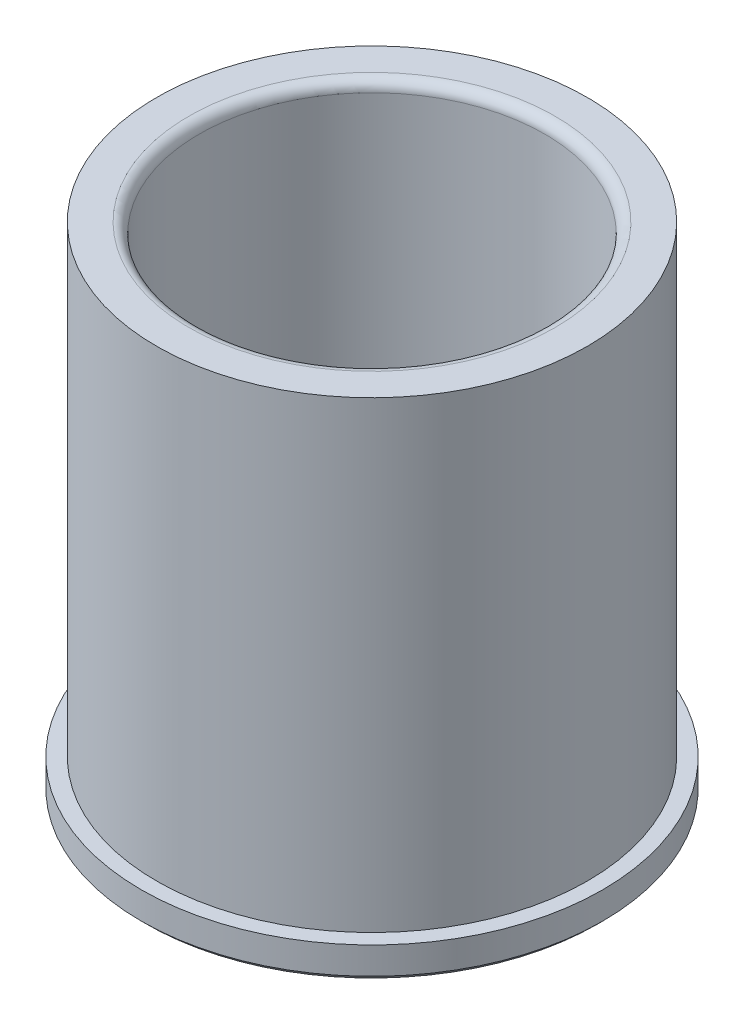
from build123d import *

# Parameters (mm, degrees)
FILLET1_R = 1.524


with BuildPart() as part:
    # Sketch1 → Revolve1 (revolve)
    with BuildSketch(Plane.XY, mode=Mode.PRIVATE) as revolve1_sk:
        Polygon((-33.2359, 0), (-33.9979, 0.762), (-33.9979, 4.7625), (-31.75635, 4.7625), (-31.75635, 73.025), (-25.4635, 73.025), (-25.4635, 0.762), (-26.2255, 0), align=None)
    revolve(revolve1_sk.sketch.rotate(Axis((0, -1000, 0), (0, 1, 0)), 180), axis=Axis((0, -1000, 0), (0, 1, 0)))

    # Fillet1
    fillet1_edges = [part.edges().sort_by_distance(p)[0] for p in [
        (-25.4635, 73.025, 0),
    ]]
    fillet(fillet1_edges, radius=FILLET1_R)


solid = part.part
